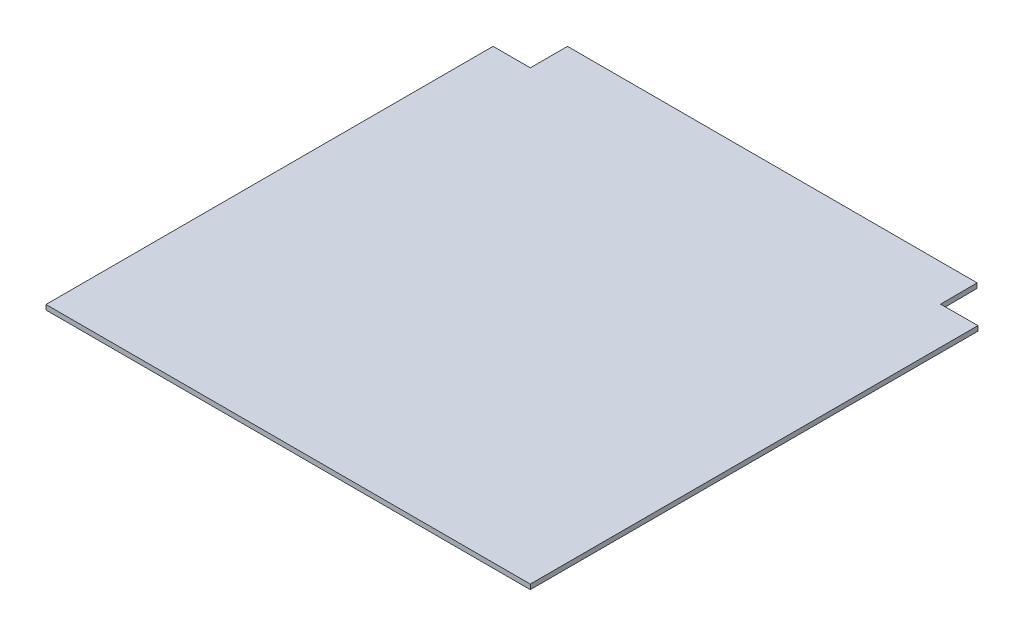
ISO-10303-21;
HEADER;
FILE_DESCRIPTION(('STEP AP214'),'2;1');
FILE_NAME('part.step','',(''),(''),'','','');
FILE_SCHEMA(('AUTOMOTIVE_DESIGN { 1 0 10303 214 1 1 1 1 }'));
ENDSEC;
DATA;
#1=APPLICATION_CONTEXT('core data for automotive mechanical design processes');
#2=APPLICATION_PROTOCOL_DEFINITION('international standard','automotive_design',2000,#1);
#3=PRODUCT_CONTEXT('',#1,'mechanical');
#4=PRODUCT('Part','Part','',(#3));
#5=PRODUCT_RELATED_PRODUCT_CATEGORY('part','',(#4));
#6=PRODUCT_DEFINITION_FORMATION('','',#4);
#7=PRODUCT_DEFINITION_CONTEXT('part definition',#1,'design');
#8=PRODUCT_DEFINITION('design','',#6,#7);
#9=PRODUCT_DEFINITION_SHAPE('','',#8);
#10=(LENGTH_UNIT() NAMED_UNIT(*) SI_UNIT(.MILLI.,.METRE.));
#11=(NAMED_UNIT(*) PLANE_ANGLE_UNIT() SI_UNIT($,.RADIAN.));
#12=(NAMED_UNIT(*) SI_UNIT($,.STERADIAN.) SOLID_ANGLE_UNIT());
#13=UNCERTAINTY_MEASURE_WITH_UNIT(LENGTH_MEASURE(1.E-05),#10,'distance_accuracy_value','');
#14=(GEOMETRIC_REPRESENTATION_CONTEXT(3) GLOBAL_UNCERTAINTY_ASSIGNED_CONTEXT((#13)) GLOBAL_UNIT_ASSIGNED_CONTEXT((#10,
#11,#12)) REPRESENTATION_CONTEXT('',''));
#15=CARTESIAN_POINT('',(0.,0.,0.));
#16=DIRECTION('',(0.,0.,1.));
#17=DIRECTION('',(1.,0.,0.));
#18=AXIS2_PLACEMENT_3D('',#15,#16,#17);
#19=CARTESIAN_POINT('',(-1.8246745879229,10.,-369.660953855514));
#20=DIRECTION('',(0.00493601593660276,0.,0.999987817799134));
#21=DIRECTION('',(0.999987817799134,0.,-0.00493601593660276));
#22=AXIS2_PLACEMENT_3D('',#19,#20,#21);
#23=PLANE('',#22);
#24=DIRECTION('',(-0.999987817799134,0.,0.00493601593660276));
#25=VECTOR('',#24,1.);
#26=CARTESIAN_POINT('',(-1.8246745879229,0.,-369.660953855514));
#27=LINE('',#26,#25);
#28=CARTESIAN_POINT('',(474.74754599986,0.,-372.013350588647));
#29=VERTEX_POINT('',#28);
#30=CARTESIAN_POINT('',(397.930322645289,0.,-371.634174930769));
#31=VERTEX_POINT('',#30);
#32=EDGE_CURVE('E133',#29,#31,#27,.T.);
#33=ORIENTED_EDGE('',*,*,#32,.T.);
#34=DIRECTION('',(0.,-1.,0.));
#35=VECTOR('',#34,1.);
#36=CARTESIAN_POINT('',(397.930322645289,10.,-371.634174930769));
#37=LINE('',#36,#35);
#38=CARTESIAN_POINT('',(397.930322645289,10.,-371.634174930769));
#39=VERTEX_POINT('',#38);
#40=EDGE_CURVE('E11',#39,#31,#37,.T.);
#41=ORIENTED_EDGE('',*,*,#40,.F.);
#42=DIRECTION('',(-0.999987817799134,0.,0.00493601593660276));
#43=VECTOR('',#42,1.);
#44=CARTESIAN_POINT('',(-1.8246745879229,10.,-369.660953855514));
#45=LINE('',#44,#43);
#46=CARTESIAN_POINT('',(474.74754599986,10.,-372.013350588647));
#47=VERTEX_POINT('',#46);
#48=EDGE_CURVE('E153',#47,#39,#45,.T.);
#49=ORIENTED_EDGE('',*,*,#48,.F.);
#50=DIRECTION('',(0.,-1.,0.));
#51=VECTOR('',#50,1.);
#52=CARTESIAN_POINT('',(474.74754599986,10.,-372.013350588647));
#53=LINE('',#52,#51);
#54=EDGE_CURVE('E52',#47,#29,#53,.T.);
#55=ORIENTED_EDGE('',*,*,#54,.T.);
#56=EDGE_LOOP('',(#33,#41,#49,#55));
#57=FACE_BOUND('',#56,.T.);
#58=ADVANCED_FACE('F36',(#57),#23,.F.);
#59=CARTESIAN_POINT('',(399.754997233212,10.,-1.97322107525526));
#60=DIRECTION('',(-0.999987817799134,0.,0.00493601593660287));
#61=DIRECTION('',(0.00493601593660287,0.,0.999987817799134));
#62=AXIS2_PLACEMENT_3D('',#59,#60,#61);
#63=PLANE('',#62);
#64=DIRECTION('',(-0.00493601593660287,0.,-0.999987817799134));
#65=VECTOR('',#64,1.);
#66=CARTESIAN_POINT('',(399.754997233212,0.,-1.97322107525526));
#67=LINE('',#66,#65);
#68=CARTESIAN_POINT('',(397.556406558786,0.,-447.385861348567));
#69=VERTEX_POINT('',#68);
#70=EDGE_CURVE('E135',#31,#69,#67,.T.);
#71=ORIENTED_EDGE('',*,*,#70,.T.);
#72=DIRECTION('',(0.,-1.,0.));
#73=VECTOR('',#72,1.);
#74=CARTESIAN_POINT('',(397.556406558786,10.,-447.385861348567));
#75=LINE('',#74,#73);
#76=CARTESIAN_POINT('',(397.556406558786,10.,-447.385861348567));
#77=VERTEX_POINT('',#76);
#78=EDGE_CURVE('E44',#77,#69,#75,.T.);
#79=ORIENTED_EDGE('',*,*,#78,.F.);
#80=DIRECTION('',(-0.00493601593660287,0.,-0.999987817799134));
#81=VECTOR('',#80,1.);
#82=CARTESIAN_POINT('',(399.754997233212,10.,-1.97322107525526));
#83=LINE('',#82,#81);
#84=EDGE_CURVE('E91',#39,#77,#83,.T.);
#85=ORIENTED_EDGE('',*,*,#84,.F.);
#86=ORIENTED_EDGE('',*,*,#40,.T.);
#87=EDGE_LOOP('',(#71,#79,#85,#86));
#88=FACE_BOUND('',#87,.T.);
#89=ADVANCED_FACE('F166',(#88),#63,.F.);
#90=CARTESIAN_POINT('',(0.,10.,-447.385861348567));
#91=DIRECTION('',(0.,0.,-1.));
#92=DIRECTION('',(-1.,0.,0.));
#93=AXIS2_PLACEMENT_3D('',#90,#91,#92);
#94=PLANE('',#93);
#95=DIRECTION('',(1.,0.,0.));
#96=VECTOR('',#95,1.);
#97=CARTESIAN_POINT('',(0.,0.,-447.385861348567));
#98=LINE('',#97,#96);
#99=CARTESIAN_POINT('',(-446.762811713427,0.,-447.385861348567));
#100=VERTEX_POINT('',#99);
#101=EDGE_CURVE('E138',#100,#69,#98,.T.);
#102=ORIENTED_EDGE('',*,*,#101,.F.);
#103=DIRECTION('',(0.,-1.,0.));
#104=VECTOR('',#103,1.);
#105=CARTESIAN_POINT('',(-446.762811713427,10.,-447.385861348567));
#106=LINE('',#105,#104);
#107=CARTESIAN_POINT('',(-446.762811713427,10.,-447.385861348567));
#108=VERTEX_POINT('',#107);
#109=EDGE_CURVE('E159',#108,#100,#106,.T.);
#110=ORIENTED_EDGE('',*,*,#109,.F.);
#111=DIRECTION('',(1.,0.,0.));
#112=VECTOR('',#111,1.);
#113=CARTESIAN_POINT('',(0.,10.,-447.385861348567));
#114=LINE('',#113,#112);
#115=EDGE_CURVE('E165',#108,#77,#114,.T.);
#116=ORIENTED_EDGE('',*,*,#115,.T.);
#117=ORIENTED_EDGE('',*,*,#78,.T.);
#118=EDGE_LOOP('',(#102,#110,#116,#117));
#119=FACE_BOUND('',#118,.T.);
#120=ADVANCED_FACE('F163',(#119),#94,.T.);
#121=CARTESIAN_POINT('',(-446.762811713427,10.,0.));
#122=DIRECTION('',(-1.,0.,0.));
#123=DIRECTION('',(0.,0.,1.));
#124=AXIS2_PLACEMENT_3D('',#121,#122,#123);
#125=PLANE('',#124);
#126=DIRECTION('',(0.,0.,-1.));
#127=VECTOR('',#126,1.);
#128=CARTESIAN_POINT('',(-446.762811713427,0.,0.));
#129=LINE('',#128,#127);
#130=CARTESIAN_POINT('',(-446.762811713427,0.,-370.745347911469));
#131=VERTEX_POINT('',#130);
#132=EDGE_CURVE('E141',#131,#100,#129,.T.);
#133=ORIENTED_EDGE('',*,*,#132,.F.);
#134=DIRECTION('',(0.,-1.,0.));
#135=VECTOR('',#134,1.);
#136=CARTESIAN_POINT('',(-446.762811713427,10.,-370.745347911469));
#137=LINE('',#136,#135);
#138=CARTESIAN_POINT('',(-446.762811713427,10.,-370.745347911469));
#139=VERTEX_POINT('',#138);
#140=EDGE_CURVE('E157',#139,#131,#137,.T.);
#141=ORIENTED_EDGE('',*,*,#140,.F.);
#142=DIRECTION('',(0.,0.,-1.));
#143=VECTOR('',#142,1.);
#144=CARTESIAN_POINT('',(-446.762811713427,10.,0.));
#145=LINE('',#144,#143);
#146=EDGE_CURVE('E175',#139,#108,#145,.T.);
#147=ORIENTED_EDGE('',*,*,#146,.T.);
#148=ORIENTED_EDGE('',*,*,#109,.T.);
#149=EDGE_LOOP('',(#133,#141,#147,#148));
#150=FACE_BOUND('',#149,.T.);
#151=ADVANCED_FACE('F173',(#150),#125,.T.);
#152=CARTESIAN_POINT('',(0.,10.,-370.745347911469));
#153=DIRECTION('',(0.,0.,-1.));
#154=DIRECTION('',(-1.,0.,0.));
#155=AXIS2_PLACEMENT_3D('',#152,#153,#154);
#156=PLANE('',#155);
#157=DIRECTION('',(1.,0.,0.));
#158=VECTOR('',#157,1.);
#159=CARTESIAN_POINT('',(0.,0.,-370.745347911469));
#160=LINE('',#159,#158);
#161=CARTESIAN_POINT('',(-523.495094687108,0.,-370.745347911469));
#162=VERTEX_POINT('',#161);
#163=EDGE_CURVE('E144',#162,#131,#160,.T.);
#164=ORIENTED_EDGE('',*,*,#163,.F.);
#165=DIRECTION('',(0.,-1.,0.));
#166=VECTOR('',#165,1.);
#167=CARTESIAN_POINT('',(-523.495094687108,10.,-370.745347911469));
#168=LINE('',#167,#166);
#169=CARTESIAN_POINT('',(-523.495094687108,10.,-370.745347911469));
#170=VERTEX_POINT('',#169);
#171=EDGE_CURVE('E125',#170,#162,#168,.T.);
#172=ORIENTED_EDGE('',*,*,#171,.F.);
#173=DIRECTION('',(1.,0.,0.));
#174=VECTOR('',#173,1.);
#175=CARTESIAN_POINT('',(0.,10.,-370.745347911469));
#176=LINE('',#175,#174);
#177=EDGE_CURVE('E115',#170,#139,#176,.T.);
#178=ORIENTED_EDGE('',*,*,#177,.T.);
#179=ORIENTED_EDGE('',*,*,#140,.T.);
#180=EDGE_LOOP('',(#164,#172,#178,#179));
#181=FACE_BOUND('',#180,.T.);
#182=ADVANCED_FACE('F181',(#181),#156,.T.);
#183=CARTESIAN_POINT('',(-523.495094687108,10.,0.));
#184=DIRECTION('',(1.,0.,0.));
#185=DIRECTION('',(0.,0.,-1.));
#186=AXIS2_PLACEMENT_3D('',#183,#184,#185);
#187=PLANE('',#186);
#188=DIRECTION('',(0.,0.,1.));
#189=VECTOR('',#188,1.);
#190=CARTESIAN_POINT('',(-523.495094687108,0.,0.));
#191=LINE('',#190,#189);
#192=CARTESIAN_POINT('',(-523.495094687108,0.,550.856779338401));
#193=VERTEX_POINT('',#192);
#194=EDGE_CURVE('E122',#162,#193,#191,.T.);
#195=ORIENTED_EDGE('',*,*,#194,.T.);
#196=DIRECTION('',(0.,-1.,0.));
#197=VECTOR('',#196,1.);
#198=CARTESIAN_POINT('',(-523.495094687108,10.,550.856779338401));
#199=LINE('',#198,#197);
#200=CARTESIAN_POINT('',(-523.495094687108,10.,550.856779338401));
#201=VERTEX_POINT('',#200);
#202=EDGE_CURVE('E119',#201,#193,#199,.T.);
#203=ORIENTED_EDGE('',*,*,#202,.F.);
#204=DIRECTION('',(0.,0.,1.));
#205=VECTOR('',#204,1.);
#206=CARTESIAN_POINT('',(-523.495094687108,10.,0.));
#207=LINE('',#206,#205);
#208=EDGE_CURVE('E107',#170,#201,#207,.T.);
#209=ORIENTED_EDGE('',*,*,#208,.F.);
#210=ORIENTED_EDGE('',*,*,#171,.T.);
#211=EDGE_LOOP('',(#195,#203,#209,#210));
#212=FACE_BOUND('',#211,.T.);
#213=ADVANCED_FACE('F120',(#212),#187,.F.);
#214=CARTESIAN_POINT('',(0.,10.,550.856779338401));
#215=DIRECTION('',(0.,0.,-1.));
#216=DIRECTION('',(-1.,0.,0.));
#217=AXIS2_PLACEMENT_3D('',#214,#215,#216);
#218=PLANE('',#217);
#219=DIRECTION('',(1.,0.,0.));
#220=VECTOR('',#219,1.);
#221=CARTESIAN_POINT('',(0.,0.,550.856779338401));
#222=LINE('',#221,#220);
#223=CARTESIAN_POINT('',(474.74754599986,0.,550.856779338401));
#224=VERTEX_POINT('',#223);
#225=EDGE_CURVE('E148',#193,#224,#222,.T.);
#226=ORIENTED_EDGE('',*,*,#225,.T.);
#227=DIRECTION('',(0.,-1.,0.));
#228=VECTOR('',#227,1.);
#229=CARTESIAN_POINT('',(474.74754599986,10.,550.856779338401));
#230=LINE('',#229,#228);
#231=CARTESIAN_POINT('',(474.74754599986,10.,550.856779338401));
#232=VERTEX_POINT('',#231);
#233=EDGE_CURVE('E79',#232,#224,#230,.T.);
#234=ORIENTED_EDGE('',*,*,#233,.F.);
#235=DIRECTION('',(1.,0.,0.));
#236=VECTOR('',#235,1.);
#237=CARTESIAN_POINT('',(0.,10.,550.856779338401));
#238=LINE('',#237,#236);
#239=EDGE_CURVE('E112',#201,#232,#238,.T.);
#240=ORIENTED_EDGE('',*,*,#239,.F.);
#241=ORIENTED_EDGE('',*,*,#202,.T.);
#242=EDGE_LOOP('',(#226,#234,#240,#241));
#243=FACE_BOUND('',#242,.T.);
#244=ADVANCED_FACE('F127',(#243),#218,.F.);
#245=CARTESIAN_POINT('',(474.74754599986,10.,0.));
#246=DIRECTION('',(1.,0.,0.));
#247=DIRECTION('',(0.,0.,-1.));
#248=AXIS2_PLACEMENT_3D('',#245,#246,#247);
#249=PLANE('',#248);
#250=DIRECTION('',(0.,0.,1.));
#251=VECTOR('',#250,1.);
#252=CARTESIAN_POINT('',(474.74754599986,0.,0.));
#253=LINE('',#252,#251);
#254=EDGE_CURVE('E150',#29,#224,#253,.T.);
#255=ORIENTED_EDGE('',*,*,#254,.F.);
#256=ORIENTED_EDGE('',*,*,#54,.F.);
#257=DIRECTION('',(0.,0.,1.));
#258=VECTOR('',#257,1.);
#259=CARTESIAN_POINT('',(474.74754599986,10.,0.));
#260=LINE('',#259,#258);
#261=EDGE_CURVE('E128',#47,#232,#260,.T.);
#262=ORIENTED_EDGE('',*,*,#261,.T.);
#263=ORIENTED_EDGE('',*,*,#233,.T.);
#264=EDGE_LOOP('',(#255,#256,#262,#263));
#265=FACE_BOUND('',#264,.T.);
#266=ADVANCED_FACE('F182',(#265),#249,.T.);
#267=CARTESIAN_POINT('',(0.,10.,0.));
#268=DIRECTION('',(0.,1.,0.));
#269=DIRECTION('',(0.,0.,1.));
#270=AXIS2_PLACEMENT_3D('',#267,#268,#269);
#271=PLANE('',#270);
#272=ORIENTED_EDGE('',*,*,#48,.T.);
#273=ORIENTED_EDGE('',*,*,#84,.T.);
#274=ORIENTED_EDGE('',*,*,#115,.F.);
#275=ORIENTED_EDGE('',*,*,#146,.F.);
#276=ORIENTED_EDGE('',*,*,#177,.F.);
#277=ORIENTED_EDGE('',*,*,#208,.T.);
#278=ORIENTED_EDGE('',*,*,#239,.T.);
#279=ORIENTED_EDGE('',*,*,#261,.F.);
#280=EDGE_LOOP('',(#272,#273,#274,#275,#276,#277,#278,#279));
#281=FACE_BOUND('',#280,.T.);
#282=ADVANCED_FACE('F109',(#281),#271,.T.);
#283=CARTESIAN_POINT('',(0.,0.,0.));
#284=DIRECTION('',(0.,1.,0.));
#285=DIRECTION('',(0.,0.,1.));
#286=AXIS2_PLACEMENT_3D('',#283,#284,#285);
#287=PLANE('',#286);
#288=ORIENTED_EDGE('',*,*,#32,.F.);
#289=ORIENTED_EDGE('',*,*,#254,.T.);
#290=ORIENTED_EDGE('',*,*,#225,.F.);
#291=ORIENTED_EDGE('',*,*,#194,.F.);
#292=ORIENTED_EDGE('',*,*,#163,.T.);
#293=ORIENTED_EDGE('',*,*,#132,.T.);
#294=ORIENTED_EDGE('',*,*,#101,.T.);
#295=ORIENTED_EDGE('',*,*,#70,.F.);
#296=EDGE_LOOP('',(#288,#289,#290,#291,#292,#293,#294,#295));
#297=FACE_BOUND('',#296,.T.);
#298=ADVANCED_FACE('F169',(#297),#287,.F.);
#299=CLOSED_SHELL('',(#58,#89,#120,#151,#182,#213,#244,#266,#282,#298));
#300=MANIFOLD_SOLID_BREP('B2',#299);
#301=ADVANCED_BREP_SHAPE_REPRESENTATION('',(#18,#300),#14);
#302=SHAPE_DEFINITION_REPRESENTATION(#9,#301);
ENDSEC;
END-ISO-10303-21;
